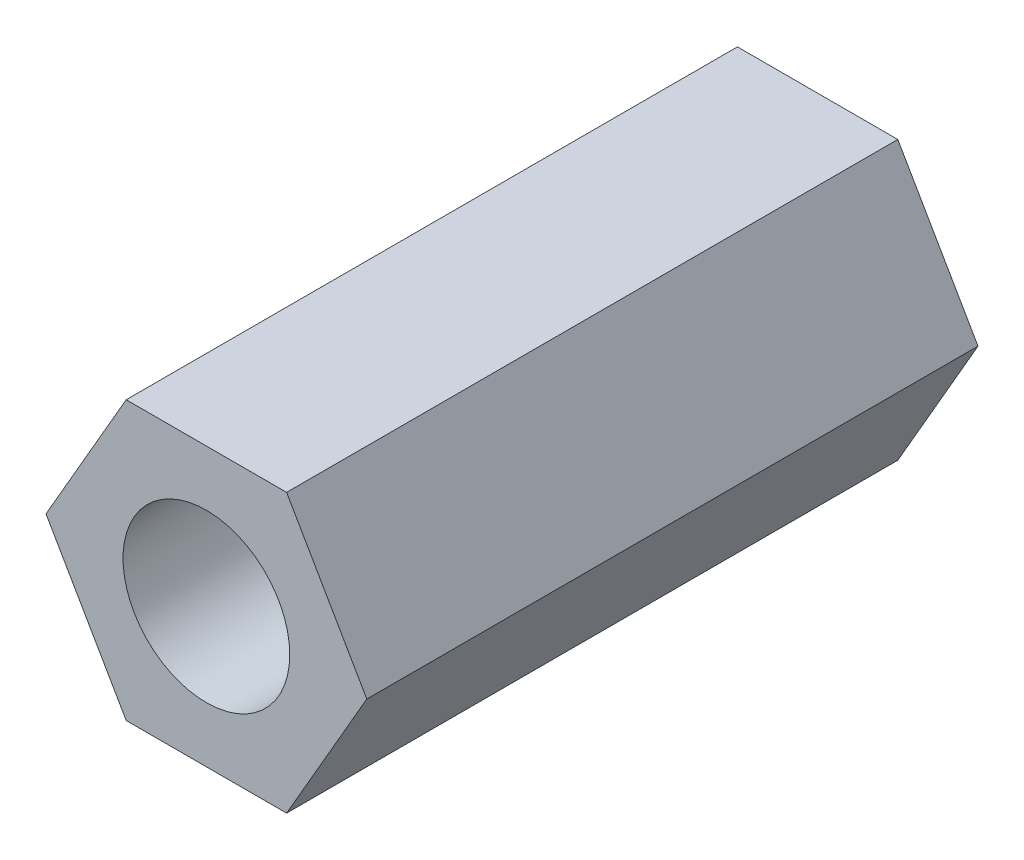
ISO-10303-21;
HEADER;
FILE_DESCRIPTION(('STEP AP214'),'2;1');
FILE_NAME('part.step','',(''),(''),'','','');
FILE_SCHEMA(('AUTOMOTIVE_DESIGN { 1 0 10303 214 1 1 1 1 }'));
ENDSEC;
DATA;
#1=APPLICATION_CONTEXT('core data for automotive mechanical design processes');
#2=APPLICATION_PROTOCOL_DEFINITION('international standard','automotive_design',2000,#1);
#3=PRODUCT_CONTEXT('',#1,'mechanical');
#4=PRODUCT('Part','Part','',(#3));
#5=PRODUCT_RELATED_PRODUCT_CATEGORY('part','',(#4));
#6=PRODUCT_DEFINITION_FORMATION('','',#4);
#7=PRODUCT_DEFINITION_CONTEXT('part definition',#1,'design');
#8=PRODUCT_DEFINITION('design','',#6,#7);
#9=PRODUCT_DEFINITION_SHAPE('','',#8);
#10=(LENGTH_UNIT() NAMED_UNIT(*) SI_UNIT(.MILLI.,.METRE.));
#11=(NAMED_UNIT(*) PLANE_ANGLE_UNIT() SI_UNIT($,.RADIAN.));
#12=(NAMED_UNIT(*) SI_UNIT($,.STERADIAN.) SOLID_ANGLE_UNIT());
#13=UNCERTAINTY_MEASURE_WITH_UNIT(LENGTH_MEASURE(1.E-05),#10,'distance_accuracy_value','');
#14=(GEOMETRIC_REPRESENTATION_CONTEXT(3) GLOBAL_UNCERTAINTY_ASSIGNED_CONTEXT((#13)) GLOBAL_UNIT_ASSIGNED_CONTEXT((#10,
#11,#12)) REPRESENTATION_CONTEXT('',''));
#15=CARTESIAN_POINT('',(0.,0.,0.));
#16=DIRECTION('',(0.,0.,1.));
#17=DIRECTION('',(1.,0.,0.));
#18=AXIS2_PLACEMENT_3D('',#15,#16,#17);
#19=CARTESIAN_POINT('',(0.,0.,11.));
#20=DIRECTION('',(0.,0.,-1.));
#21=DIRECTION('',(-1.,0.,0.));
#22=AXIS2_PLACEMENT_3D('',#19,#20,#21);
#23=CYLINDRICAL_SURFACE('',#22,1.25);
#24=CARTESIAN_POINT('',(0.,0.,0.));
#25=DIRECTION('',(0.,0.,1.));
#26=DIRECTION('',(1.,0.,0.));
#27=AXIS2_PLACEMENT_3D('',#24,#25,#26);
#28=CIRCLE('',#27,1.25);
#29=CARTESIAN_POINT('',(1.25,0.,0.));
#30=VERTEX_POINT('',#29);
#31=EDGE_CURVE('E104',#30,#30,#28,.T.);
#32=ORIENTED_EDGE('',*,*,#31,.F.);
#33=EDGE_LOOP('',(#32));
#34=FACE_BOUND('',#33,.T.);
#35=CARTESIAN_POINT('',(0.,0.,7.));
#36=DIRECTION('',(0.,0.,1.));
#37=DIRECTION('',(1.,0.,0.));
#38=AXIS2_PLACEMENT_3D('',#35,#36,#37);
#39=CIRCLE('',#38,1.25);
#40=CARTESIAN_POINT('',(1.25,0.,7.));
#41=VERTEX_POINT('',#40);
#42=EDGE_CURVE('E35',#41,#41,#39,.T.);
#43=ORIENTED_EDGE('',*,*,#42,.T.);
#44=EDGE_LOOP('',(#43));
#45=FACE_BOUND('',#44,.T.);
#46=ADVANCED_FACE('F31',(#34,#45),#23,.F.);
#47=CARTESIAN_POINT('',(2.88675134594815,0.,11.));
#48=DIRECTION('',(0.,0.,1.));
#49=DIRECTION('',(1.,0.,0.));
#50=AXIS2_PLACEMENT_3D('',#47,#48,#49);
#51=PLANE('',#50);
#52=CARTESIAN_POINT('',(0.,0.,11.));
#53=DIRECTION('',(0.,0.,1.));
#54=DIRECTION('',(1.,0.,0.));
#55=AXIS2_PLACEMENT_3D('',#52,#53,#54);
#56=CIRCLE('',#55,1.5);
#57=CARTESIAN_POINT('',(1.5,0.,11.));
#58=VERTEX_POINT('',#57);
#59=EDGE_CURVE('E223',#58,#58,#56,.T.);
#60=ORIENTED_EDGE('',*,*,#59,.F.);
#61=EDGE_LOOP('',(#60));
#62=FACE_BOUND('',#61,.T.);
#63=DIRECTION('',(0.500000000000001,0.866025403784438,0.));
#64=VECTOR('',#63,1.);
#65=CARTESIAN_POINT('',(1.4433756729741,-2.5,11.));
#66=LINE('',#65,#64);
#67=CARTESIAN_POINT('',(1.4433756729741,-2.5,11.));
#68=VERTEX_POINT('',#67);
#69=CARTESIAN_POINT('',(2.88675134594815,0.,11.));
#70=VERTEX_POINT('',#69);
#71=EDGE_CURVE('E117',#68,#70,#66,.T.);
#72=ORIENTED_EDGE('',*,*,#71,.T.);
#73=DIRECTION('',(-0.500000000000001,0.866025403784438,0.));
#74=VECTOR('',#73,1.);
#75=CARTESIAN_POINT('',(2.88675134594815,0.,11.));
#76=LINE('',#75,#74);
#77=CARTESIAN_POINT('',(1.44337567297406,2.5,11.));
#78=VERTEX_POINT('',#77);
#79=EDGE_CURVE('E99',#70,#78,#76,.T.);
#80=ORIENTED_EDGE('',*,*,#79,.T.);
#81=DIRECTION('',(-1.,0.,0.));
#82=VECTOR('',#81,1.);
#83=CARTESIAN_POINT('',(1.44337567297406,2.5,11.));
#84=LINE('',#83,#82);
#85=CARTESIAN_POINT('',(-1.44337567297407,2.5,11.));
#86=VERTEX_POINT('',#85);
#87=EDGE_CURVE('E120',#78,#86,#84,.T.);
#88=ORIENTED_EDGE('',*,*,#87,.T.);
#89=DIRECTION('',(-0.499999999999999,-0.866025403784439,0.));
#90=VECTOR('',#89,1.);
#91=CARTESIAN_POINT('',(-1.44337567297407,2.5,11.));
#92=LINE('',#91,#90);
#93=CARTESIAN_POINT('',(-2.88675134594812,0.,11.));
#94=VERTEX_POINT('',#93);
#95=EDGE_CURVE('E122',#86,#94,#92,.T.);
#96=ORIENTED_EDGE('',*,*,#95,.T.);
#97=DIRECTION('',(0.5,-0.866025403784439,0.));
#98=VECTOR('',#97,1.);
#99=CARTESIAN_POINT('',(-2.88675134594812,0.,11.));
#100=LINE('',#99,#98);
#101=CARTESIAN_POINT('',(-1.44337567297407,-2.5,11.));
#102=VERTEX_POINT('',#101);
#103=EDGE_CURVE('E52',#94,#102,#100,.T.);
#104=ORIENTED_EDGE('',*,*,#103,.T.);
#105=DIRECTION('',(1.,0.,0.));
#106=VECTOR('',#105,1.);
#107=CARTESIAN_POINT('',(-1.44337567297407,-2.5,11.));
#108=LINE('',#107,#106);
#109=EDGE_CURVE('E47',#102,#68,#108,.T.);
#110=ORIENTED_EDGE('',*,*,#109,.T.);
#111=EDGE_LOOP('',(#72,#80,#88,#96,#104,#110));
#112=FACE_BOUND('',#111,.T.);
#113=ADVANCED_FACE('F141',(#62,#112),#51,.T.);
#114=CARTESIAN_POINT('',(2.88675134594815,0.,0.));
#115=DIRECTION('',(0.,0.,1.));
#116=DIRECTION('',(1.,0.,0.));
#117=AXIS2_PLACEMENT_3D('',#114,#115,#116);
#118=PLANE('',#117);
#119=DIRECTION('',(0.500000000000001,0.866025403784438,0.));
#120=VECTOR('',#119,1.);
#121=CARTESIAN_POINT('',(1.4433756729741,-2.5,0.));
#122=LINE('',#121,#120);
#123=CARTESIAN_POINT('',(1.4433756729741,-2.5,0.));
#124=VERTEX_POINT('',#123);
#125=CARTESIAN_POINT('',(2.88675134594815,0.,0.));
#126=VERTEX_POINT('',#125);
#127=EDGE_CURVE('E90',#124,#126,#122,.T.);
#128=ORIENTED_EDGE('',*,*,#127,.F.);
#129=DIRECTION('',(1.,0.,0.));
#130=VECTOR('',#129,1.);
#131=CARTESIAN_POINT('',(-1.44337567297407,-2.5,0.));
#132=LINE('',#131,#130);
#133=CARTESIAN_POINT('',(-1.44337567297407,-2.5,0.));
#134=VERTEX_POINT('',#133);
#135=EDGE_CURVE('E115',#134,#124,#132,.T.);
#136=ORIENTED_EDGE('',*,*,#135,.F.);
#137=DIRECTION('',(0.5,-0.866025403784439,0.));
#138=VECTOR('',#137,1.);
#139=CARTESIAN_POINT('',(-2.88675134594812,0.,0.));
#140=LINE('',#139,#138);
#141=CARTESIAN_POINT('',(-2.88675134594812,0.,0.));
#142=VERTEX_POINT('',#141);
#143=EDGE_CURVE('E113',#142,#134,#140,.T.);
#144=ORIENTED_EDGE('',*,*,#143,.F.);
#145=DIRECTION('',(-0.499999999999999,-0.866025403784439,0.));
#146=VECTOR('',#145,1.);
#147=CARTESIAN_POINT('',(-1.44337567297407,2.5,0.));
#148=LINE('',#147,#146);
#149=CARTESIAN_POINT('',(-1.44337567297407,2.5,0.));
#150=VERTEX_POINT('',#149);
#151=EDGE_CURVE('E111',#150,#142,#148,.T.);
#152=ORIENTED_EDGE('',*,*,#151,.F.);
#153=DIRECTION('',(-1.,0.,0.));
#154=VECTOR('',#153,1.);
#155=CARTESIAN_POINT('',(1.44337567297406,2.5,0.));
#156=LINE('',#155,#154);
#157=CARTESIAN_POINT('',(1.44337567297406,2.5,0.));
#158=VERTEX_POINT('',#157);
#159=EDGE_CURVE('E92',#158,#150,#156,.T.);
#160=ORIENTED_EDGE('',*,*,#159,.F.);
#161=DIRECTION('',(-0.500000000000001,0.866025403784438,0.));
#162=VECTOR('',#161,1.);
#163=CARTESIAN_POINT('',(2.88675134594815,0.,0.));
#164=LINE('',#163,#162);
#165=EDGE_CURVE('E85',#126,#158,#164,.T.);
#166=ORIENTED_EDGE('',*,*,#165,.F.);
#167=EDGE_LOOP('',(#128,#136,#144,#152,#160,#166));
#168=FACE_BOUND('',#167,.T.);
#169=ORIENTED_EDGE('',*,*,#31,.T.);
#170=EDGE_LOOP('',(#169));
#171=FACE_BOUND('',#170,.T.);
#172=ADVANCED_FACE('F86',(#168,#171),#118,.F.);
#173=CARTESIAN_POINT('',(1.4433756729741,-2.5,11.));
#174=DIRECTION('',(-0.866025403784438,0.500000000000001,0.));
#175=DIRECTION('',(-0.500000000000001,-0.866025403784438,0.));
#176=AXIS2_PLACEMENT_3D('',#173,#174,#175);
#177=PLANE('',#176);
#178=ORIENTED_EDGE('',*,*,#127,.T.);
#179=DIRECTION('',(0.,0.,-1.));
#180=VECTOR('',#179,1.);
#181=CARTESIAN_POINT('',(2.88675134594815,0.,11.));
#182=LINE('',#181,#180);
#183=EDGE_CURVE('E11',#70,#126,#182,.T.);
#184=ORIENTED_EDGE('',*,*,#183,.F.);
#185=ORIENTED_EDGE('',*,*,#71,.F.);
#186=DIRECTION('',(0.,0.,-1.));
#187=VECTOR('',#186,1.);
#188=CARTESIAN_POINT('',(1.4433756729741,-2.5,11.));
#189=LINE('',#188,#187);
#190=EDGE_CURVE('E103',#68,#124,#189,.T.);
#191=ORIENTED_EDGE('',*,*,#190,.T.);
#192=EDGE_LOOP('',(#178,#184,#185,#191));
#193=FACE_BOUND('',#192,.T.);
#194=ADVANCED_FACE('F33',(#193),#177,.F.);
#195=CARTESIAN_POINT('',(2.88675134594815,0.,11.));
#196=DIRECTION('',(-0.866025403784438,-0.500000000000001,0.));
#197=DIRECTION('',(0.500000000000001,-0.866025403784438,0.));
#198=AXIS2_PLACEMENT_3D('',#195,#196,#197);
#199=PLANE('',#198);
#200=ORIENTED_EDGE('',*,*,#165,.T.);
#201=DIRECTION('',(0.,0.,-1.));
#202=VECTOR('',#201,1.);
#203=CARTESIAN_POINT('',(1.44337567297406,2.5,11.));
#204=LINE('',#203,#202);
#205=EDGE_CURVE('E40',#78,#158,#204,.T.);
#206=ORIENTED_EDGE('',*,*,#205,.F.);
#207=ORIENTED_EDGE('',*,*,#79,.F.);
#208=ORIENTED_EDGE('',*,*,#183,.T.);
#209=EDGE_LOOP('',(#200,#206,#207,#208));
#210=FACE_BOUND('',#209,.T.);
#211=ADVANCED_FACE('F98',(#210),#199,.F.);
#212=CARTESIAN_POINT('',(1.44337567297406,2.5,11.));
#213=DIRECTION('',(0.,-1.,0.));
#214=DIRECTION('',(0.,0.,-1.));
#215=AXIS2_PLACEMENT_3D('',#212,#213,#214);
#216=PLANE('',#215);
#217=ORIENTED_EDGE('',*,*,#159,.T.);
#218=DIRECTION('',(0.,0.,-1.));
#219=VECTOR('',#218,1.);
#220=CARTESIAN_POINT('',(-1.44337567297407,2.5,11.));
#221=LINE('',#220,#219);
#222=EDGE_CURVE('E133',#86,#150,#221,.T.);
#223=ORIENTED_EDGE('',*,*,#222,.F.);
#224=ORIENTED_EDGE('',*,*,#87,.F.);
#225=ORIENTED_EDGE('',*,*,#205,.T.);
#226=EDGE_LOOP('',(#217,#223,#224,#225));
#227=FACE_BOUND('',#226,.T.);
#228=ADVANCED_FACE('F138',(#227),#216,.F.);
#229=CARTESIAN_POINT('',(-1.44337567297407,2.5,11.));
#230=DIRECTION('',(0.866025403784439,-0.499999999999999,0.));
#231=DIRECTION('',(0.499999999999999,0.866025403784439,0.));
#232=AXIS2_PLACEMENT_3D('',#229,#230,#231);
#233=PLANE('',#232);
#234=ORIENTED_EDGE('',*,*,#151,.T.);
#235=DIRECTION('',(0.,0.,-1.));
#236=VECTOR('',#235,1.);
#237=CARTESIAN_POINT('',(-2.88675134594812,0.,11.));
#238=LINE('',#237,#236);
#239=EDGE_CURVE('E130',#94,#142,#238,.T.);
#240=ORIENTED_EDGE('',*,*,#239,.F.);
#241=ORIENTED_EDGE('',*,*,#95,.F.);
#242=ORIENTED_EDGE('',*,*,#222,.T.);
#243=EDGE_LOOP('',(#234,#240,#241,#242));
#244=FACE_BOUND('',#243,.T.);
#245=ADVANCED_FACE('F144',(#244),#233,.F.);
#246=CARTESIAN_POINT('',(-2.88675134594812,0.,11.));
#247=DIRECTION('',(0.866025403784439,0.5,0.));
#248=DIRECTION('',(-0.5,0.866025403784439,0.));
#249=AXIS2_PLACEMENT_3D('',#246,#247,#248);
#250=PLANE('',#249);
#251=ORIENTED_EDGE('',*,*,#143,.T.);
#252=DIRECTION('',(0.,0.,-1.));
#253=VECTOR('',#252,1.);
#254=CARTESIAN_POINT('',(-1.44337567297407,-2.5,11.));
#255=LINE('',#254,#253);
#256=EDGE_CURVE('E127',#102,#134,#255,.T.);
#257=ORIENTED_EDGE('',*,*,#256,.F.);
#258=ORIENTED_EDGE('',*,*,#103,.F.);
#259=ORIENTED_EDGE('',*,*,#239,.T.);
#260=EDGE_LOOP('',(#251,#257,#258,#259));
#261=FACE_BOUND('',#260,.T.);
#262=ADVANCED_FACE('F147',(#261),#250,.F.);
#263=CARTESIAN_POINT('',(-1.44337567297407,-2.5,11.));
#264=DIRECTION('',(0.,1.,0.));
#265=DIRECTION('',(0.,0.,1.));
#266=AXIS2_PLACEMENT_3D('',#263,#264,#265);
#267=PLANE('',#266);
#268=ORIENTED_EDGE('',*,*,#135,.T.);
#269=ORIENTED_EDGE('',*,*,#190,.F.);
#270=ORIENTED_EDGE('',*,*,#109,.F.);
#271=ORIENTED_EDGE('',*,*,#256,.T.);
#272=EDGE_LOOP('',(#268,#269,#270,#271));
#273=FACE_BOUND('',#272,.T.);
#274=ADVANCED_FACE('F149',(#273),#267,.F.);
#275=CARTESIAN_POINT('',(0.,0.,7.));
#276=DIRECTION('',(0.,0.,1.));
#277=DIRECTION('',(1.,0.,0.));
#278=AXIS2_PLACEMENT_3D('',#275,#276,#277);
#279=CYLINDRICAL_SURFACE('',#278,1.5);
#280=CARTESIAN_POINT('',(0.,0.,7.));
#281=DIRECTION('',(0.,0.,1.));
#282=DIRECTION('',(1.,0.,0.));
#283=AXIS2_PLACEMENT_3D('',#280,#281,#282);
#284=CIRCLE('',#283,1.5);
#285=CARTESIAN_POINT('',(1.5,0.,7.));
#286=VERTEX_POINT('',#285);
#287=EDGE_CURVE('E222',#286,#286,#284,.T.);
#288=ORIENTED_EDGE('',*,*,#287,.F.);
#289=EDGE_LOOP('',(#288));
#290=FACE_BOUND('',#289,.T.);
#291=ORIENTED_EDGE('',*,*,#59,.T.);
#292=EDGE_LOOP('',(#291));
#293=FACE_BOUND('',#292,.T.);
#294=ADVANCED_FACE('F151',(#290,#293),#279,.F.);
#295=CARTESIAN_POINT('',(0.,0.,7.));
#296=DIRECTION('',(0.,0.,1.));
#297=DIRECTION('',(1.,0.,0.));
#298=AXIS2_PLACEMENT_3D('',#295,#296,#297);
#299=PLANE('',#298);
#300=ORIENTED_EDGE('',*,*,#42,.F.);
#301=EDGE_LOOP('',(#300));
#302=FACE_BOUND('',#301,.T.);
#303=ORIENTED_EDGE('',*,*,#287,.T.);
#304=EDGE_LOOP('',(#303));
#305=FACE_BOUND('',#304,.T.);
#306=ADVANCED_FACE('F157',(#302,#305),#299,.T.);
#307=CLOSED_SHELL('',(#46,#113,#172,#194,#211,#228,#245,#262,#274,#294,#306));
#308=MANIFOLD_SOLID_BREP('B2',#307);
#309=ADVANCED_BREP_SHAPE_REPRESENTATION('',(#18,#308),#14);
#310=SHAPE_DEFINITION_REPRESENTATION(#9,#309);
ENDSEC;
END-ISO-10303-21;
